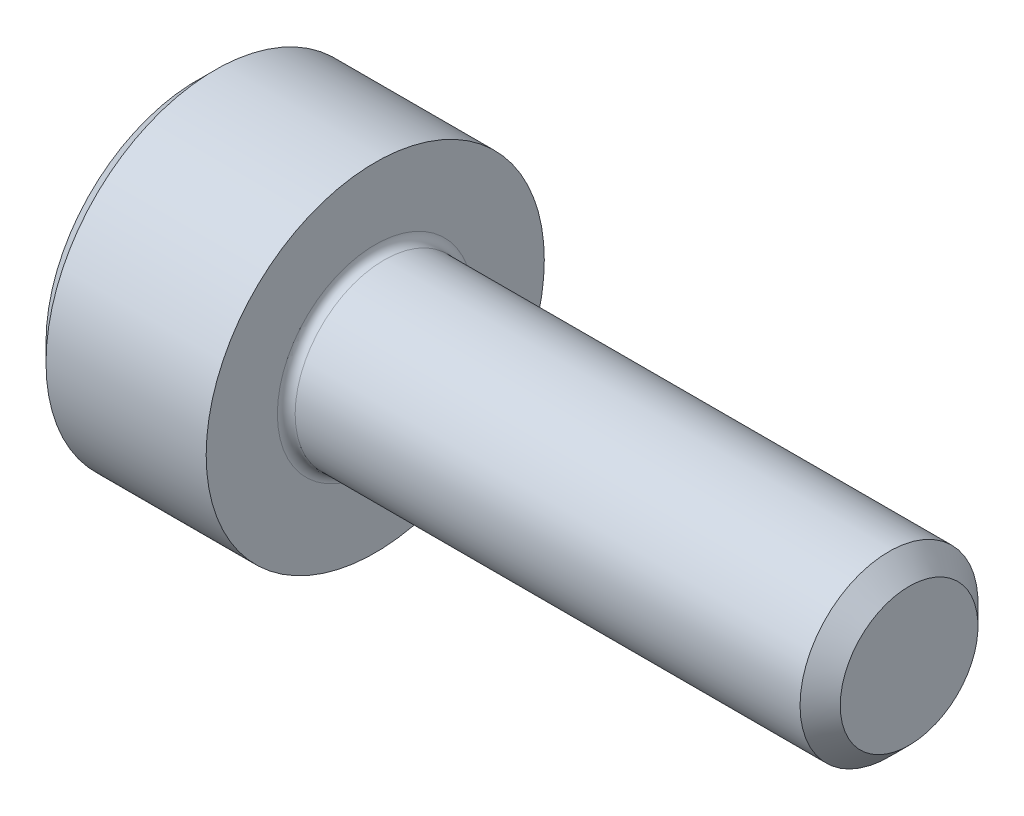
from build123d import *

# Parameters (mm, degrees)
FILLET1_R   = 0.1
HEX_2_DEPTH = 1


with BuildPart() as part:
    # BodySke → Base-Revolve (revolve)
    with BuildSketch(Plane.XY, mode=Mode.PRIVATE) as base_revolve_sk:
        Polygon((0, 0), (0, 1.7), (0.2, 1.9), (2, 1.9), (2, 1), (7.774, 1), (8, 0.774), (8, 0), align=None)
    revolve(base_revolve_sk.sketch.rotate(Axis((-31.75, 0, 0), (1, 0, 0)), 90), axis=Axis((-31.75, 0, 0), (1, 0, 0)))

    # Fillet1
    fillet1_edges = [part.edges().sort_by_distance(p)[0] for p in [
        (2, 0, -1),
    ]]
    fillet(fillet1_edges, radius=FILLET1_R)

    # Sketch2 → Hex-PreBroach (revolve, cut)
    with BuildSketch(Plane.XY, mode=Mode.PRIVATE) as hex_prebroach_sk:
        Polygon((0, 0.7725), (1, 0.7725), (1.446003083, 0), (0, 0), align=None)
    revolve(hex_prebroach_sk.sketch.rotate(Axis((0, 0, 0), (1, 0, 0)), 90), axis=Axis((0, 0, 0), (1, 0, 0)), mode=Mode.SUBTRACT)

    # Sketch3 → Hex 2 (cut)
    with BuildSketch(Plane(origin=(0, 0, 0), x_dir=(0, 0.500000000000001, 0.866025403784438), z_dir=(-1, 0, 0))):
        Polygon((0.446003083, 0.7725), (-0.446003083, 0.7725), (-0.892006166, 0), (-0.446003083, -0.7725), (0.446003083, -0.7725), (0.892006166, 0), align=None)
    extrude(amount=-HEX_2_DEPTH, mode=Mode.SUBTRACT)


solid = part.part
